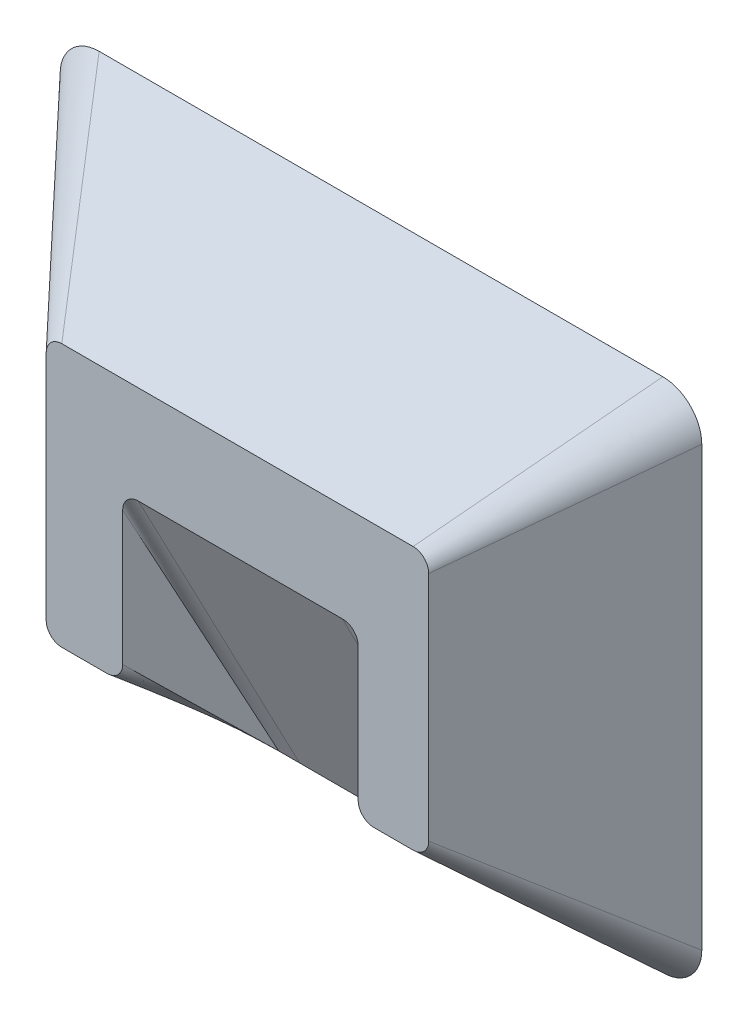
ISO-10303-21;
HEADER;
FILE_DESCRIPTION(('STEP AP214'),'2;1');
FILE_NAME('part.step','',(''),(''),'','','');
FILE_SCHEMA(('AUTOMOTIVE_DESIGN { 1 0 10303 214 1 1 1 1 }'));
ENDSEC;
DATA;
#1=APPLICATION_CONTEXT('core data for automotive mechanical design processes');
#2=APPLICATION_PROTOCOL_DEFINITION('international standard','automotive_design',2000,#1);
#3=PRODUCT_CONTEXT('',#1,'mechanical');
#4=PRODUCT('Part','Part','',(#3));
#5=PRODUCT_RELATED_PRODUCT_CATEGORY('part','',(#4));
#6=PRODUCT_DEFINITION_FORMATION('','',#4);
#7=PRODUCT_DEFINITION_CONTEXT('part definition',#1,'design');
#8=PRODUCT_DEFINITION('design','',#6,#7);
#9=PRODUCT_DEFINITION_SHAPE('','',#8);
#10=(LENGTH_UNIT() NAMED_UNIT(*) SI_UNIT(.MILLI.,.METRE.));
#11=(NAMED_UNIT(*) PLANE_ANGLE_UNIT() SI_UNIT($,.RADIAN.));
#12=(NAMED_UNIT(*) SI_UNIT($,.STERADIAN.) SOLID_ANGLE_UNIT());
#13=UNCERTAINTY_MEASURE_WITH_UNIT(LENGTH_MEASURE(1.E-05),#10,'distance_accuracy_value','');
#14=(GEOMETRIC_REPRESENTATION_CONTEXT(3) GLOBAL_UNCERTAINTY_ASSIGNED_CONTEXT((#13)) GLOBAL_UNIT_ASSIGNED_CONTEXT((#10,
#11,#12)) REPRESENTATION_CONTEXT('',''));
#15=CARTESIAN_POINT('',(0.,0.,0.));
#16=DIRECTION('',(0.,0.,1.));
#17=DIRECTION('',(1.,0.,0.));
#18=AXIS2_PLACEMENT_3D('',#15,#16,#17);
#19=CARTESIAN_POINT('',(82.8574926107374,24.8922566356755,25.4));
#20=DIRECTION('',(0.,0.,-1.));
#21=DIRECTION('',(-1.,0.,0.));
#22=AXIS2_PLACEMENT_3D('',#19,#20,#21);
#23=PLANE('',#22);
#24=CARTESIAN_POINT('',(82.8574926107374,24.8922566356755,25.4));
#25=DIRECTION('',(0.,0.,1.));
#26=DIRECTION('',(-1.,0.,0.));
#27=AXIS2_PLACEMENT_3D('',#24,#25,#26);
#28=CIRCLE('',#27,2.54);
#29=CARTESIAN_POINT('',(82.8574926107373,22.3522566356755,25.4));
#30=VERTEX_POINT('',#29);
#31=CARTESIAN_POINT('',(85.3974926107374,24.8922566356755,25.4));
#32=VERTEX_POINT('',#31);
#33=EDGE_CURVE('E151',#30,#32,#28,.T.);
#34=ORIENTED_EDGE('',*,*,#33,.T.);
#35=DIRECTION('',(0.,1.,0.));
#36=VECTOR('',#35,1.);
#37=CARTESIAN_POINT('',(85.3974926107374,24.8922566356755,25.4));
#38=LINE('',#37,#36);
#39=CARTESIAN_POINT('',(85.3974926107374,62.6175079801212,25.4));
#40=VERTEX_POINT('',#39);
#41=EDGE_CURVE('E162',#32,#40,#38,.T.);
#42=ORIENTED_EDGE('',*,*,#41,.T.);
#43=CARTESIAN_POINT('',(82.8574926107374,62.6175079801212,25.4));
#44=DIRECTION('',(0.,0.,1.));
#45=DIRECTION('',(1.,0.,0.));
#46=AXIS2_PLACEMENT_3D('',#43,#44,#45);
#47=CIRCLE('',#46,2.54);
#48=CARTESIAN_POINT('',(82.8574926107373,65.1575079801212,25.4));
#49=VERTEX_POINT('',#48);
#50=EDGE_CURVE('E168',#40,#49,#47,.T.);
#51=ORIENTED_EDGE('',*,*,#50,.T.);
#52=DIRECTION('',(-1.,0.,0.));
#53=VECTOR('',#52,1.);
#54=CARTESIAN_POINT('',(82.8574926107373,65.1575079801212,25.4));
#55=LINE('',#54,#53);
#56=CARTESIAN_POINT('',(25.6753088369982,65.1575079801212,25.4));
#57=VERTEX_POINT('',#56);
#58=EDGE_CURVE('E347',#49,#57,#55,.T.);
#59=ORIENTED_EDGE('',*,*,#58,.T.);
#60=CARTESIAN_POINT('',(25.6753088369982,62.6175079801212,25.4));
#61=DIRECTION('',(0.,0.,1.));
#62=DIRECTION('',(1.,0.,0.));
#63=AXIS2_PLACEMENT_3D('',#60,#61,#62);
#64=CIRCLE('',#63,2.54);
#65=CARTESIAN_POINT('',(23.1353088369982,62.6175079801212,25.4));
#66=VERTEX_POINT('',#65);
#67=EDGE_CURVE('E340',#57,#66,#64,.T.);
#68=ORIENTED_EDGE('',*,*,#67,.T.);
#69=DIRECTION('',(0.,-1.,0.));
#70=VECTOR('',#69,1.);
#71=CARTESIAN_POINT('',(23.1353088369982,62.6175079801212,25.4));
#72=LINE('',#71,#70);
#73=CARTESIAN_POINT('',(23.1353088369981,24.8922566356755,25.4));
#74=VERTEX_POINT('',#73);
#75=EDGE_CURVE('E344',#66,#74,#72,.T.);
#76=ORIENTED_EDGE('',*,*,#75,.T.);
#77=CARTESIAN_POINT('',(25.6753088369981,24.8922566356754,25.4));
#78=DIRECTION('',(0.,0.,1.));
#79=DIRECTION('',(1.,0.,0.));
#80=AXIS2_PLACEMENT_3D('',#77,#78,#79);
#81=CIRCLE('',#80,2.54);
#82=CARTESIAN_POINT('',(25.6753088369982,22.3522566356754,25.4));
#83=VERTEX_POINT('',#82);
#84=EDGE_CURVE('E345',#74,#83,#81,.T.);
#85=ORIENTED_EDGE('',*,*,#84,.T.);
#86=DIRECTION('',(1.,0.,0.));
#87=VECTOR('',#86,1.);
#88=CARTESIAN_POINT('',(25.6753088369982,22.3522566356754,25.4));
#89=LINE('',#88,#87);
#90=CARTESIAN_POINT('',(33.047745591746,22.3522566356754,25.4));
#91=VERTEX_POINT('',#90);
#92=EDGE_CURVE('E349',#83,#91,#89,.T.);
#93=ORIENTED_EDGE('',*,*,#92,.T.);
#94=CARTESIAN_POINT('',(33.047745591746,24.8922566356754,25.4));
#95=DIRECTION('',(0.,0.,1.));
#96=DIRECTION('',(1.,0.,0.));
#97=AXIS2_PLACEMENT_3D('',#94,#95,#96);
#98=CIRCLE('',#97,2.54);
#99=CARTESIAN_POINT('',(35.587745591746,24.8922566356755,25.4));
#100=VERTEX_POINT('',#99);
#101=EDGE_CURVE('E274',#91,#100,#98,.T.);
#102=ORIENTED_EDGE('',*,*,#101,.T.);
#103=DIRECTION('',(0.,1.,0.));
#104=VECTOR('',#103,1.);
#105=CARTESIAN_POINT('',(35.587745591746,24.8922566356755,25.4));
#106=LINE('',#105,#104);
#107=CARTESIAN_POINT('',(35.587745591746,46.6628233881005,25.4));
#108=VERTEX_POINT('',#107);
#109=EDGE_CURVE('E278',#100,#108,#106,.T.);
#110=ORIENTED_EDGE('',*,*,#109,.T.);
#111=CARTESIAN_POINT('',(38.127745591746,46.6628233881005,25.4));
#112=DIRECTION('',(0.,0.,-1.));
#113=DIRECTION('',(-1.,0.,0.));
#114=AXIS2_PLACEMENT_3D('',#111,#112,#113);
#115=CIRCLE('',#114,2.54);
#116=CARTESIAN_POINT('',(38.127745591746,49.2028233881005,25.4));
#117=VERTEX_POINT('',#116);
#118=EDGE_CURVE('E292',#108,#117,#115,.T.);
#119=ORIENTED_EDGE('',*,*,#118,.T.);
#120=DIRECTION('',(1.,0.,0.));
#121=VECTOR('',#120,1.);
#122=CARTESIAN_POINT('',(38.127745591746,49.2028233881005,25.4));
#123=LINE('',#122,#121);
#124=CARTESIAN_POINT('',(71.3779024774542,49.2028233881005,25.4));
#125=VERTEX_POINT('',#124);
#126=EDGE_CURVE('E290',#117,#125,#123,.T.);
#127=ORIENTED_EDGE('',*,*,#126,.T.);
#128=CARTESIAN_POINT('',(71.3779024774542,46.6628233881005,25.4));
#129=DIRECTION('',(0.,0.,-1.));
#130=DIRECTION('',(-1.,0.,0.));
#131=AXIS2_PLACEMENT_3D('',#128,#129,#130);
#132=CIRCLE('',#131,2.54);
#133=CARTESIAN_POINT('',(73.9179024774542,46.6628233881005,25.4));
#134=VERTEX_POINT('',#133);
#135=EDGE_CURVE('E293',#125,#134,#132,.T.);
#136=ORIENTED_EDGE('',*,*,#135,.T.);
#137=DIRECTION('',(0.,-1.,0.));
#138=VECTOR('',#137,1.);
#139=CARTESIAN_POINT('',(73.9179024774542,46.6628233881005,25.4));
#140=LINE('',#139,#138);
#141=CARTESIAN_POINT('',(73.9179024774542,24.8922566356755,25.4));
#142=VERTEX_POINT('',#141);
#143=EDGE_CURVE('E296',#134,#142,#140,.T.);
#144=ORIENTED_EDGE('',*,*,#143,.T.);
#145=CARTESIAN_POINT('',(76.4579024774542,24.8922566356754,25.4));
#146=DIRECTION('',(0.,0.,1.));
#147=DIRECTION('',(1.,0.,0.));
#148=AXIS2_PLACEMENT_3D('',#145,#146,#147);
#149=CIRCLE('',#148,2.54);
#150=CARTESIAN_POINT('',(76.4579024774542,22.3522566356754,25.4));
#151=VERTEX_POINT('',#150);
#152=EDGE_CURVE('E173',#142,#151,#149,.T.);
#153=ORIENTED_EDGE('',*,*,#152,.T.);
#154=DIRECTION('',(1.,0.,0.));
#155=VECTOR('',#154,1.);
#156=CARTESIAN_POINT('',(76.4579024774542,22.3522566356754,25.4));
#157=LINE('',#156,#155);
#158=EDGE_CURVE('E171',#151,#30,#157,.T.);
#159=ORIENTED_EDGE('',*,*,#158,.T.);
#160=EDGE_LOOP('',(#34,#42,#51,#59,#68,#76,#85,#93,#102,#110,#119,#127,#136,#144,#153,#159));
#161=FACE_BOUND('',#160,.T.);
#162=ADVANCED_FACE('F37',(#161),#23,.F.);
#163=CARTESIAN_POINT('',(6.35,77.6575167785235,0.));
#164=DIRECTION('',(0.,0.,-1.));
#165=DIRECTION('',(-1.,0.,0.));
#166=AXIS2_PLACEMENT_3D('',#163,#164,#165);
#167=PLANE('',#166);
#168=CARTESIAN_POINT('',(6.35,77.6575167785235,0.));
#169=DIRECTION('',(0.,0.,1.));
#170=DIRECTION('',(-1.,0.,0.));
#171=AXIS2_PLACEMENT_3D('',#168,#169,#170);
#172=CIRCLE('',#171,6.35);
#173=CARTESIAN_POINT('',(6.35000000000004,84.0075167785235,0.));
#174=VERTEX_POINT('',#173);
#175=CARTESIAN_POINT('',(0.,77.6575167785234,0.));
#176=VERTEX_POINT('',#175);
#177=EDGE_CURVE('E41',#174,#176,#172,.T.);
#178=ORIENTED_EDGE('',*,*,#177,.F.);
#179=DIRECTION('',(-1.,0.,0.));
#180=VECTOR('',#179,1.);
#181=CARTESIAN_POINT('',(6.35000000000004,84.0075167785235,0.));
#182=LINE('',#181,#180);
#183=CARTESIAN_POINT('',(98.0968456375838,84.0075167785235,0.));
#184=VERTEX_POINT('',#183);
#185=EDGE_CURVE('E219',#184,#174,#182,.T.);
#186=ORIENTED_EDGE('',*,*,#185,.F.);
#187=CARTESIAN_POINT('',(98.0968456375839,77.6575167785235,0.));
#188=DIRECTION('',(0.,0.,1.));
#189=DIRECTION('',(-1.,0.,0.));
#190=AXIS2_PLACEMENT_3D('',#187,#188,#189);
#191=CIRCLE('',#190,6.34999999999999);
#192=CARTESIAN_POINT('',(104.446845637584,77.6575167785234,0.));
#193=VERTEX_POINT('',#192);
#194=EDGE_CURVE('E216',#193,#184,#191,.T.);
#195=ORIENTED_EDGE('',*,*,#194,.F.);
#196=DIRECTION('',(0.,1.,0.));
#197=VECTOR('',#196,1.);
#198=CARTESIAN_POINT('',(104.446845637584,6.35000000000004,0.));
#199=LINE('',#198,#197);
#200=CARTESIAN_POINT('',(104.446845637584,6.35000000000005,0.));
#201=VERTEX_POINT('',#200);
#202=EDGE_CURVE('E215',#201,#193,#199,.T.);
#203=ORIENTED_EDGE('',*,*,#202,.F.);
#204=CARTESIAN_POINT('',(98.0968456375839,6.35,0.));
#205=DIRECTION('',(0.,0.,1.));
#206=DIRECTION('',(1.,0.,0.));
#207=AXIS2_PLACEMENT_3D('',#204,#205,#206);
#208=CIRCLE('',#207,6.35);
#209=CARTESIAN_POINT('',(98.0968456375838,0.,0.));
#210=VERTEX_POINT('',#209);
#211=EDGE_CURVE('E154',#210,#201,#208,.T.);
#212=ORIENTED_EDGE('',*,*,#211,.F.);
#213=DIRECTION('',(1.,0.,0.));
#214=VECTOR('',#213,1.);
#215=CARTESIAN_POINT('',(73.9179024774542,0.,0.));
#216=LINE('',#215,#214);
#217=CARTESIAN_POINT('',(82.6104478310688,0.,0.));
#218=VERTEX_POINT('',#217);
#219=EDGE_CURVE('E213',#218,#210,#216,.T.);
#220=ORIENTED_EDGE('',*,*,#219,.F.);
#221=CARTESIAN_POINT('',(73.9179024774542,0.,0.));
#222=VERTEX_POINT('',#221);
#223=EDGE_CURVE('E211',#222,#218,#216,.T.);
#224=ORIENTED_EDGE('',*,*,#223,.F.);
#225=DIRECTION('',(1.,0.,0.));
#226=VECTOR('',#225,1.);
#227=CARTESIAN_POINT('',(35.587745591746,0.,0.));
#228=LINE('',#227,#226);
#229=CARTESIAN_POINT('',(70.5127331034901,0.,0.));
#230=VERTEX_POINT('',#229);
#231=EDGE_CURVE('E210',#230,#222,#228,.T.);
#232=ORIENTED_EDGE('',*,*,#231,.F.);
#233=CARTESIAN_POINT('',(38.9929149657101,0.,0.));
#234=VERTEX_POINT('',#233);
#235=EDGE_CURVE('E209',#234,#230,#228,.T.);
#236=ORIENTED_EDGE('',*,*,#235,.F.);
#237=CARTESIAN_POINT('',(35.587745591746,0.,0.));
#238=VERTEX_POINT('',#237);
#239=EDGE_CURVE('E207',#238,#234,#228,.T.);
#240=ORIENTED_EDGE('',*,*,#239,.F.);
#241=DIRECTION('',(1.,0.,0.));
#242=VECTOR('',#241,1.);
#243=CARTESIAN_POINT('',(6.35000000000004,0.,0.));
#244=LINE('',#243,#242);
#245=CARTESIAN_POINT('',(26.0091417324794,0.,0.));
#246=VERTEX_POINT('',#245);
#247=EDGE_CURVE('E206',#246,#238,#244,.T.);
#248=ORIENTED_EDGE('',*,*,#247,.F.);
#249=CARTESIAN_POINT('',(6.35000000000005,0.,0.));
#250=VERTEX_POINT('',#249);
#251=EDGE_CURVE('E204',#250,#246,#244,.T.);
#252=ORIENTED_EDGE('',*,*,#251,.F.);
#253=CARTESIAN_POINT('',(6.35,6.35,0.));
#254=DIRECTION('',(0.,0.,1.));
#255=DIRECTION('',(-1.,0.,0.));
#256=AXIS2_PLACEMENT_3D('',#253,#254,#255);
#257=CIRCLE('',#256,6.35);
#258=CARTESIAN_POINT('',(0.,6.35000000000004,0.));
#259=VERTEX_POINT('',#258);
#260=EDGE_CURVE('E46',#259,#250,#257,.T.);
#261=ORIENTED_EDGE('',*,*,#260,.F.);
#262=DIRECTION('',(0.,-1.,0.));
#263=VECTOR('',#262,1.);
#264=CARTESIAN_POINT('',(0.,6.35000000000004,0.));
#265=LINE('',#264,#263);
#266=EDGE_CURVE('E12',#176,#259,#265,.T.);
#267=ORIENTED_EDGE('',*,*,#266,.F.);
#268=EDGE_LOOP('',(#178,#186,#195,#203,#212,#220,#224,#232,#236,#240,#248,#252,#261,#267));
#269=FACE_BOUND('',#268,.T.);
#270=ADVANCED_FACE('F39',(#269),#167,.T.);
#271=CARTESIAN_POINT('',(29.5284436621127,11.1761283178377,12.7));
#272=DIRECTION('',(0.,-0.750709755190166,0.660632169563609));
#273=DIRECTION('',(0.,-0.660632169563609,-0.750709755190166));
#274=AXIS2_PLACEMENT_3D('',#271,#272,#273);
#275=PLANE('',#274);
#276=DIRECTION('',(0.203669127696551,0.646785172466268,0.73497471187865));
#277=VECTOR('',#276,1.);
#278=CARTESIAN_POINT('',(29.5284436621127,11.1761283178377,12.7));
#279=LINE('',#278,#277);
#280=EDGE_CURVE('E196',#246,#91,#279,.T.);
#281=ORIENTED_EDGE('',*,*,#280,.T.);
#282=ORIENTED_EDGE('',*,*,#92,.F.);
#283=DIRECTION('',(0.495969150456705,0.573653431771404,0.651871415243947));
#284=VECTOR('',#283,1.);
#285=CARTESIAN_POINT('',(16.0126544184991,11.1761283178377,12.7));
#286=LINE('',#285,#284);
#287=EDGE_CURVE('E191',#250,#83,#286,.T.);
#288=ORIENTED_EDGE('',*,*,#287,.F.);
#289=ORIENTED_EDGE('',*,*,#251,.T.);
#290=EDGE_LOOP('',(#281,#282,#288,#289));
#291=FACE_BOUND('',#290,.T.);
#292=ADVANCED_FACE('F357',(#291),#275,.T.);
#293=CARTESIAN_POINT('',(0.,6.35,0.));
#294=CARTESIAN_POINT('',(23.1353088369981,24.8922566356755,25.4));
#295=CARTESIAN_POINT('',(0.,2.63025612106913,0.));
#296=CARTESIAN_POINT('',(23.1353088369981,23.4043590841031,25.4));
#297=CARTESIAN_POINT('',(2.63025612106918,0.,0.));
#298=CARTESIAN_POINT('',(24.1874112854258,22.3522566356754,25.4));
#299=CARTESIAN_POINT('',(6.35000000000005,0.,0.));
#300=CARTESIAN_POINT('',(25.6753088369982,22.3522566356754,25.4));
#301=(BOUNDED_SURFACE() B_SPLINE_SURFACE(3,1,((#293,#294),(#295,#296),(#297,#298),(#299,#300)),
.UNSPECIFIED.,.F.,.F.,.F.) B_SPLINE_SURFACE_WITH_KNOTS((4,4),(2,2),(0.,1.),(0.,1.),
.UNSPECIFIED.) GEOMETRIC_REPRESENTATION_ITEM() RATIONAL_B_SPLINE_SURFACE(((1.,1.),
(0.804737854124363,0.804737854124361),(0.804737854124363,0.804737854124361),(1.,1.))) REPRESENTATION_ITEM('') SURFACE());
#302=DIRECTION('',(0.592586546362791,0.474940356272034,0.650594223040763));
#303=VECTOR('',#302,1.);
#304=CARTESIAN_POINT('',(11.5676544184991,15.6211283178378,12.7));
#305=LINE('',#304,#303);
#306=EDGE_CURVE('E60',#259,#74,#305,.T.);
#307=ORIENTED_EDGE('',*,*,#260,.T.);
#308=ORIENTED_EDGE('',*,*,#287,.T.);
#309=ORIENTED_EDGE('',*,*,#84,.F.);
#310=ORIENTED_EDGE('',*,*,#306,.F.);
#311=EDGE_LOOP('',(#307,#308,#309,#310));
#312=FACE_BOUND('',#311,.T.);
#313=ADVANCED_FACE('F358',(#312),#301,.T.);
#314=CARTESIAN_POINT('',(26.0091417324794,0.,0.));
#315=CARTESIAN_POINT('',(33.047745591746,22.3522566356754,25.4));
#316=CARTESIAN_POINT('',(29.2020096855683,0.,0.));
#317=CARTESIAN_POINT('',(34.5356431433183,22.3522566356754,25.4));
#318=CARTESIAN_POINT('',(32.3948776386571,0.,0.));
#319=CARTESIAN_POINT('',(35.587745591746,23.4043590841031,25.4));
#320=CARTESIAN_POINT('',(35.587745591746,0.,0.));
#321=CARTESIAN_POINT('',(35.587745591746,24.8922566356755,25.4));
#322=(BOUNDED_SURFACE() B_SPLINE_SURFACE(3,1,((#314,#315),(#316,#317),(#318,#319),(#320,#321)),
.UNSPECIFIED.,.F.,.F.,.F.) B_SPLINE_SURFACE_WITH_KNOTS((4,4),(2,2),(0.,1.),(0.,1.),
.UNSPECIFIED.) GEOMETRIC_REPRESENTATION_ITEM() RATIONAL_B_SPLINE_SURFACE(((1.,1.),(1.,
0.804737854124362),(1.,0.804737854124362),(1.,1.))) REPRESENTATION_ITEM('') SURFACE());
#323=DIRECTION('',(0.,0.699932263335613,0.714209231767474));
#324=VECTOR('',#323,1.);
#325=CARTESIAN_POINT('',(35.587745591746,12.4461283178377,12.7));
#326=LINE('',#325,#324);
#327=EDGE_CURVE('E197',#238,#100,#326,.T.);
#328=ORIENTED_EDGE('',*,*,#247,.T.);
#329=ORIENTED_EDGE('',*,*,#327,.T.);
#330=ORIENTED_EDGE('',*,*,#101,.F.);
#331=ORIENTED_EDGE('',*,*,#280,.F.);
#332=EDGE_LOOP('',(#328,#329,#330,#331));
#333=FACE_BOUND('',#332,.T.);
#334=ADVANCED_FACE('F272',(#333),#322,.T.);
#335=CARTESIAN_POINT('',(35.587745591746,23.3314116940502,12.7));
#336=DIRECTION('',(1.,0.,0.));
#337=DIRECTION('',(0.,0.,-1.));
#338=AXIS2_PLACEMENT_3D('',#335,#336,#337);
#339=PLANE('',#338);
#340=DIRECTION('',(0.,0.878310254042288,0.478091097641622));
#341=VECTOR('',#340,1.);
#342=CARTESIAN_POINT('',(35.587745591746,23.3314116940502,12.7));
#343=LINE('',#342,#341);
#344=EDGE_CURVE('E258',#238,#108,#343,.T.);
#345=ORIENTED_EDGE('',*,*,#344,.T.);
#346=ORIENTED_EDGE('',*,*,#109,.F.);
#347=ORIENTED_EDGE('',*,*,#327,.F.);
#348=EDGE_LOOP('',(#345,#346,#347));
#349=FACE_BOUND('',#348,.T.);
#350=ADVANCED_FACE('F277',(#349),#339,.T.);
#351=CARTESIAN_POINT('',(35.587745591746,0.,0.));
#352=CARTESIAN_POINT('',(35.587745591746,46.6628233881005,25.4));
#353=CARTESIAN_POINT('',(36.722802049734,0.,0.));
#354=CARTESIAN_POINT('',(35.587745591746,48.1507209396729,25.4));
#355=CARTESIAN_POINT('',(37.8578585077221,0.,0.));
#356=CARTESIAN_POINT('',(36.6398480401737,49.2028233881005,25.4));
#357=CARTESIAN_POINT('',(38.9929149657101,0.,0.));
#358=CARTESIAN_POINT('',(38.127745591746,49.2028233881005,25.4));
#359=(BOUNDED_SURFACE() B_SPLINE_SURFACE(3,1,((#351,#352),(#353,#354),(#355,#356),(#357,#358)),
.UNSPECIFIED.,.F.,.F.,.F.) B_SPLINE_SURFACE_WITH_KNOTS((4,4),(2,2),(0.,1.),(0.,1.),
.UNSPECIFIED.) GEOMETRIC_REPRESENTATION_ITEM() RATIONAL_B_SPLINE_SURFACE(((1.,1.),(1.,
0.804737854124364),(1.,0.804737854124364),(1.,1.))) REPRESENTATION_ITEM('') SURFACE());
#360=DIRECTION('',(-0.0156227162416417,0.888475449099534,0.458658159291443));
#361=VECTOR('',#360,1.);
#362=CARTESIAN_POINT('',(38.560330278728,24.6014116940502,12.7));
#363=LINE('',#362,#361);
#364=EDGE_CURVE('E254',#234,#117,#363,.T.);
#365=ORIENTED_EDGE('',*,*,#239,.T.);
#366=ORIENTED_EDGE('',*,*,#364,.T.);
#367=ORIENTED_EDGE('',*,*,#118,.F.);
#368=ORIENTED_EDGE('',*,*,#344,.F.);
#369=EDGE_LOOP('',(#365,#366,#367,#368));
#370=FACE_BOUND('',#369,.T.);
#371=ADVANCED_FACE('F284',(#370),#359,.T.);
#372=CARTESIAN_POINT('',(70.9453177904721,24.6014116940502,12.7));
#373=DIRECTION('',(0.,-0.458714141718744,0.888583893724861));
#374=DIRECTION('',(0.,-0.888583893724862,-0.458714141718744));
#375=AXIS2_PLACEMENT_3D('',#372,#373,#374);
#376=PLANE('',#375);
#377=DIRECTION('',(0.0156227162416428,0.888475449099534,0.458658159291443));
#378=VECTOR('',#377,1.);
#379=CARTESIAN_POINT('',(70.9453177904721,24.6014116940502,12.7));
#380=LINE('',#379,#378);
#381=EDGE_CURVE('E250',#230,#125,#380,.T.);
#382=ORIENTED_EDGE('',*,*,#381,.T.);
#383=ORIENTED_EDGE('',*,*,#126,.F.);
#384=ORIENTED_EDGE('',*,*,#364,.F.);
#385=ORIENTED_EDGE('',*,*,#235,.T.);
#386=EDGE_LOOP('',(#382,#383,#384,#385));
#387=FACE_BOUND('',#386,.T.);
#388=ADVANCED_FACE('F288',(#387),#376,.T.);
#389=CARTESIAN_POINT('',(70.5127331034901,0.,0.));
#390=CARTESIAN_POINT('',(71.3779024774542,49.2028233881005,25.4));
#391=CARTESIAN_POINT('',(71.6477895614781,0.,0.));
#392=CARTESIAN_POINT('',(72.8658000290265,49.2028233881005,25.4));
#393=CARTESIAN_POINT('',(72.7828460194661,0.,0.));
#394=CARTESIAN_POINT('',(73.9179024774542,48.1507209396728,25.4));
#395=CARTESIAN_POINT('',(73.9179024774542,0.,0.));
#396=CARTESIAN_POINT('',(73.9179024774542,46.6628233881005,25.4));
#397=(BOUNDED_SURFACE() B_SPLINE_SURFACE(3,1,((#389,#390),(#391,#392),(#393,#394),(#395,#396)),
.UNSPECIFIED.,.F.,.F.,.F.) B_SPLINE_SURFACE_WITH_KNOTS((4,4),(2,2),(0.,1.),(0.,1.),
.UNSPECIFIED.) GEOMETRIC_REPRESENTATION_ITEM() RATIONAL_B_SPLINE_SURFACE(((1.,1.),(1.,
0.804737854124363),(1.,0.804737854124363),(1.,1.))) REPRESENTATION_ITEM('') SURFACE());
#398=DIRECTION('',(0.,0.878310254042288,0.478091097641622));
#399=VECTOR('',#398,1.);
#400=CARTESIAN_POINT('',(73.9179024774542,23.3314116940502,12.7));
#401=LINE('',#400,#399);
#402=EDGE_CURVE('E242',#222,#134,#401,.T.);
#403=ORIENTED_EDGE('',*,*,#231,.T.);
#404=ORIENTED_EDGE('',*,*,#402,.T.);
#405=ORIENTED_EDGE('',*,*,#135,.F.);
#406=ORIENTED_EDGE('',*,*,#381,.F.);
#407=EDGE_LOOP('',(#403,#404,#405,#406));
#408=FACE_BOUND('',#407,.T.);
#409=ADVANCED_FACE('F422',(#408),#397,.T.);
#410=CARTESIAN_POINT('',(73.9179024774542,12.4461283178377,12.7));
#411=DIRECTION('',(-1.,0.,0.));
#412=DIRECTION('',(0.,0.,1.));
#413=AXIS2_PLACEMENT_3D('',#410,#411,#412);
#414=PLANE('',#413);
#415=DIRECTION('',(0.,0.699932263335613,0.714209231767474));
#416=VECTOR('',#415,1.);
#417=CARTESIAN_POINT('',(73.9179024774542,12.4461283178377,12.7));
#418=LINE('',#417,#416);
#419=EDGE_CURVE('E237',#222,#142,#418,.T.);
#420=ORIENTED_EDGE('',*,*,#419,.T.);
#421=ORIENTED_EDGE('',*,*,#143,.F.);
#422=ORIENTED_EDGE('',*,*,#402,.F.);
#423=EDGE_LOOP('',(#420,#421,#422));
#424=FACE_BOUND('',#423,.T.);
#425=ADVANCED_FACE('F414',(#424),#414,.T.);
#426=CARTESIAN_POINT('',(73.9179024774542,0.,0.));
#427=CARTESIAN_POINT('',(73.9179024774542,24.8922566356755,25.4));
#428=CARTESIAN_POINT('',(76.8154175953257,0.,0.));
#429=CARTESIAN_POINT('',(73.9179024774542,23.4043590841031,25.4));
#430=CARTESIAN_POINT('',(79.7129327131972,0.,0.));
#431=CARTESIAN_POINT('',(74.9700049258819,22.3522566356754,25.4));
#432=CARTESIAN_POINT('',(82.6104478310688,0.,0.));
#433=CARTESIAN_POINT('',(76.4579024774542,22.3522566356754,25.4));
#434=(BOUNDED_SURFACE() B_SPLINE_SURFACE(3,1,((#426,#427),(#428,#429),(#430,#431),(#432,#433)),
.UNSPECIFIED.,.F.,.F.,.F.) B_SPLINE_SURFACE_WITH_KNOTS((4,4),(2,2),(0.,1.),(0.,1.),
.UNSPECIFIED.) GEOMETRIC_REPRESENTATION_ITEM() RATIONAL_B_SPLINE_SURFACE(((1.,1.),(1.,
0.804737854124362),(1.,0.804737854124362),(1.,1.))) REPRESENTATION_ITEM('') SURFACE());
#435=DIRECTION('',(-0.1789077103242,0.649973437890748,0.738597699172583));
#436=VECTOR('',#435,1.);
#437=CARTESIAN_POINT('',(79.5341751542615,11.1761283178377,12.7));
#438=LINE('',#437,#436);
#439=EDGE_CURVE('E230',#218,#151,#438,.T.);
#440=ORIENTED_EDGE('',*,*,#223,.T.);
#441=ORIENTED_EDGE('',*,*,#439,.T.);
#442=ORIENTED_EDGE('',*,*,#152,.F.);
#443=ORIENTED_EDGE('',*,*,#419,.F.);
#444=EDGE_LOOP('',(#440,#441,#442,#443));
#445=FACE_BOUND('',#444,.T.);
#446=ADVANCED_FACE('F308',(#445),#434,.T.);
#447=CARTESIAN_POINT('',(90.4771691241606,11.1761283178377,12.7));
#448=DIRECTION('',(0.,-0.750709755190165,0.66063216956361));
#449=DIRECTION('',(0.,-0.66063216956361,-0.750709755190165));
#450=AXIS2_PLACEMENT_3D('',#447,#448,#449);
#451=PLANE('',#450);
#452=DIRECTION('',(-0.410673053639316,0.602352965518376,0.684484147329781));
#453=VECTOR('',#452,1.);
#454=CARTESIAN_POINT('',(90.4771691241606,11.1761283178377,12.7));
#455=LINE('',#454,#453);
#456=EDGE_CURVE('E158',#210,#30,#455,.T.);
#457=ORIENTED_EDGE('',*,*,#456,.T.);
#458=ORIENTED_EDGE('',*,*,#158,.F.);
#459=ORIENTED_EDGE('',*,*,#439,.F.);
#460=ORIENTED_EDGE('',*,*,#219,.T.);
#461=EDGE_LOOP('',(#457,#458,#459,#460));
#462=FACE_BOUND('',#461,.T.);
#463=ADVANCED_FACE('F306',(#462),#451,.T.);
#464=CARTESIAN_POINT('',(98.0968456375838,0.,0.));
#465=CARTESIAN_POINT('',(82.8574926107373,22.3522566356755,25.4));
#466=CARTESIAN_POINT('',(101.816589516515,0.,0.));
#467=CARTESIAN_POINT('',(84.3453901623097,22.3522566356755,25.4));
#468=CARTESIAN_POINT('',(104.446845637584,2.63025612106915,0.));
#469=CARTESIAN_POINT('',(85.3974926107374,23.4043590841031,25.4));
#470=CARTESIAN_POINT('',(104.446845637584,6.35000000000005,0.));
#471=CARTESIAN_POINT('',(85.3974926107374,24.8922566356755,25.4));
#472=(BOUNDED_SURFACE() B_SPLINE_SURFACE(3,1,((#464,#465),(#466,#467),(#468,#469),(#470,#471)),
.UNSPECIFIED.,.F.,.F.,.F.) B_SPLINE_SURFACE_WITH_KNOTS((4,4),(2,2),(0.,1.),(0.,1.),
.UNSPECIFIED.) GEOMETRIC_REPRESENTATION_ITEM() RATIONAL_B_SPLINE_SURFACE(((1.,1.),
(0.804737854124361,0.804737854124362),(0.804737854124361,0.804737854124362),(1.,1.))) REPRESENTATION_ITEM('') SURFACE());
#473=DIRECTION('',(-0.518102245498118,0.504310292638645,0.690826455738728));
#474=VECTOR('',#473,1.);
#475=CARTESIAN_POINT('',(94.9221691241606,15.6211283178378,12.7));
#476=LINE('',#475,#474);
#477=EDGE_CURVE('E146',#201,#32,#476,.T.);
#478=ORIENTED_EDGE('',*,*,#211,.T.);
#479=ORIENTED_EDGE('',*,*,#477,.T.);
#480=ORIENTED_EDGE('',*,*,#33,.F.);
#481=ORIENTED_EDGE('',*,*,#456,.F.);
#482=EDGE_LOOP('',(#478,#479,#480,#481));
#483=FACE_BOUND('',#482,.T.);
#484=ADVANCED_FACE('F148',(#483),#472,.T.);
#485=CARTESIAN_POINT('',(94.9221691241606,70.1375123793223,12.7));
#486=DIRECTION('',(0.80000978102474,0.,0.599986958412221));
#487=DIRECTION('',(0.599986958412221,0.,-0.80000978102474));
#488=AXIS2_PLACEMENT_3D('',#485,#486,#487);
#489=PLANE('',#488);
#490=DIRECTION('',(-0.542226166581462,-0.428103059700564,0.722992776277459));
#491=VECTOR('',#490,1.);
#492=CARTESIAN_POINT('',(94.9221691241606,70.1375123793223,12.7));
#493=LINE('',#492,#491);
#494=EDGE_CURVE('E159',#193,#40,#493,.T.);
#495=ORIENTED_EDGE('',*,*,#494,.T.);
#496=ORIENTED_EDGE('',*,*,#41,.F.);
#497=ORIENTED_EDGE('',*,*,#477,.F.);
#498=ORIENTED_EDGE('',*,*,#202,.T.);
#499=EDGE_LOOP('',(#495,#496,#497,#498));
#500=FACE_BOUND('',#499,.T.);
#501=ADVANCED_FACE('F163',(#500),#489,.T.);
#502=CARTESIAN_POINT('',(104.446845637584,77.6575167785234,0.));
#503=CARTESIAN_POINT('',(85.3974926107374,62.6175079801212,25.4));
#504=CARTESIAN_POINT('',(104.446845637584,81.3772606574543,0.));
#505=CARTESIAN_POINT('',(85.3974926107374,64.1054055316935,25.4));
#506=CARTESIAN_POINT('',(101.816589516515,84.0075167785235,0.));
#507=CARTESIAN_POINT('',(84.3453901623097,65.1575079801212,25.4));
#508=CARTESIAN_POINT('',(98.0968456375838,84.0075167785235,0.));
#509=CARTESIAN_POINT('',(82.8574926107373,65.1575079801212,25.4));
#510=(BOUNDED_SURFACE() B_SPLINE_SURFACE(3,1,((#502,#503),(#504,#505),(#506,#507),(#508,#509)),
.UNSPECIFIED.,.F.,.F.,.F.) B_SPLINE_SURFACE_WITH_KNOTS((4,4),(2,2),(0.,1.),(0.,1.),
.UNSPECIFIED.) GEOMETRIC_REPRESENTATION_ITEM() RATIONAL_B_SPLINE_SURFACE(((1.,1.),
(0.804737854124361,0.804737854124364),(0.804737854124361,0.804737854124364),(1.,1.))) REPRESENTATION_ITEM('') SURFACE());
#511=DIRECTION('',(-0.434044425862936,-0.536882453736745,0.723438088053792));
#512=VECTOR('',#511,1.);
#513=CARTESIAN_POINT('',(90.4771691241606,74.5825123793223,12.7));
#514=LINE('',#513,#512);
#515=EDGE_CURVE('E318',#184,#49,#514,.T.);
#516=ORIENTED_EDGE('',*,*,#194,.T.);
#517=ORIENTED_EDGE('',*,*,#515,.T.);
#518=ORIENTED_EDGE('',*,*,#50,.F.);
#519=ORIENTED_EDGE('',*,*,#494,.F.);
#520=EDGE_LOOP('',(#516,#517,#518,#519));
#521=FACE_BOUND('',#520,.T.);
#522=ADVANCED_FACE('F314',(#521),#510,.T.);
#523=CARTESIAN_POINT('',(16.0126544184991,74.5825123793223,12.7));
#524=DIRECTION('',(0.,0.803024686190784,0.595945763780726));
#525=DIRECTION('',(0.,-0.595945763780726,0.803024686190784));
#526=AXIS2_PLACEMENT_3D('',#523,#524,#525);
#527=PLANE('',#526);
#528=DIRECTION('',(0.521363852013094,-0.508541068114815,0.685248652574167));
#529=VECTOR('',#528,1.);
#530=CARTESIAN_POINT('',(16.0126544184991,74.5825123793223,12.7));
#531=LINE('',#530,#529);
#532=EDGE_CURVE('E321',#174,#57,#531,.T.);
#533=ORIENTED_EDGE('',*,*,#532,.T.);
#534=ORIENTED_EDGE('',*,*,#58,.F.);
#535=ORIENTED_EDGE('',*,*,#515,.F.);
#536=ORIENTED_EDGE('',*,*,#185,.T.);
#537=EDGE_LOOP('',(#533,#534,#535,#536));
#538=FACE_BOUND('',#537,.T.);
#539=ADVANCED_FACE('F380',(#538),#527,.T.);
#540=CARTESIAN_POINT('',(6.35000000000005,84.0075167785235,0.));
#541=CARTESIAN_POINT('',(25.6753088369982,65.1575079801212,25.4));
#542=CARTESIAN_POINT('',(2.63025612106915,84.0075167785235,0.));
#543=CARTESIAN_POINT('',(24.1874112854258,65.1575079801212,25.4));
#544=CARTESIAN_POINT('',(0.,81.3772606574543,0.));
#545=CARTESIAN_POINT('',(23.1353088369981,64.1054055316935,25.4));
#546=CARTESIAN_POINT('',(0.,77.6575167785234,0.));
#547=CARTESIAN_POINT('',(23.1353088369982,62.6175079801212,25.4));
#548=(BOUNDED_SURFACE() B_SPLINE_SURFACE(3,1,((#540,#541),(#542,#543),(#544,#545),(#546,#547)),
.UNSPECIFIED.,.F.,.F.,.F.) B_SPLINE_SURFACE_WITH_KNOTS((4,4),(2,2),(0.,1.),(0.,1.),
.UNSPECIFIED.) GEOMETRIC_REPRESENTATION_ITEM() RATIONAL_B_SPLINE_SURFACE(((1.,1.),
(0.804737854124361,0.804737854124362),(0.804737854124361,0.804737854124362),(1.,1.))) REPRESENTATION_ITEM('') SURFACE());
#549=DIRECTION('',(0.616863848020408,-0.401016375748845,0.677248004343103));
#550=VECTOR('',#549,1.);
#551=CARTESIAN_POINT('',(11.5676544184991,70.1375123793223,12.7));
#552=LINE('',#551,#550);
#553=EDGE_CURVE('E180',#176,#66,#552,.T.);
#554=ORIENTED_EDGE('',*,*,#177,.T.);
#555=ORIENTED_EDGE('',*,*,#553,.T.);
#556=ORIENTED_EDGE('',*,*,#67,.F.);
#557=ORIENTED_EDGE('',*,*,#532,.F.);
#558=EDGE_LOOP('',(#554,#555,#556,#557));
#559=FACE_BOUND('',#558,.T.);
#560=ADVANCED_FACE('F339',(#559),#548,.T.);
#561=CARTESIAN_POINT('',(11.5676544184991,15.6211283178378,12.7));
#562=DIRECTION('',(-0.739296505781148,0.,0.673380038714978));
#563=DIRECTION('',(0.673380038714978,0.,0.739296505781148));
#564=AXIS2_PLACEMENT_3D('',#561,#562,#563);
#565=PLANE('',#564);
#566=ORIENTED_EDGE('',*,*,#306,.T.);
#567=ORIENTED_EDGE('',*,*,#75,.F.);
#568=ORIENTED_EDGE('',*,*,#553,.F.);
#569=ORIENTED_EDGE('',*,*,#266,.T.);
#570=EDGE_LOOP('',(#566,#567,#568,#569));
#571=FACE_BOUND('',#570,.T.);
#572=ADVANCED_FACE('F343',(#571),#565,.T.);
#573=CLOSED_SHELL('',(#162,#270,#292,#313,#334,#350,#371,#388,#409,#425,#446,#463,#484,#501,
#522,#539,#560,#572));
#574=MANIFOLD_SOLID_BREP('B2',#573);
#575=ADVANCED_BREP_SHAPE_REPRESENTATION('',(#18,#574),#14);
#576=SHAPE_DEFINITION_REPRESENTATION(#9,#575);
ENDSEC;
END-ISO-10303-21;
